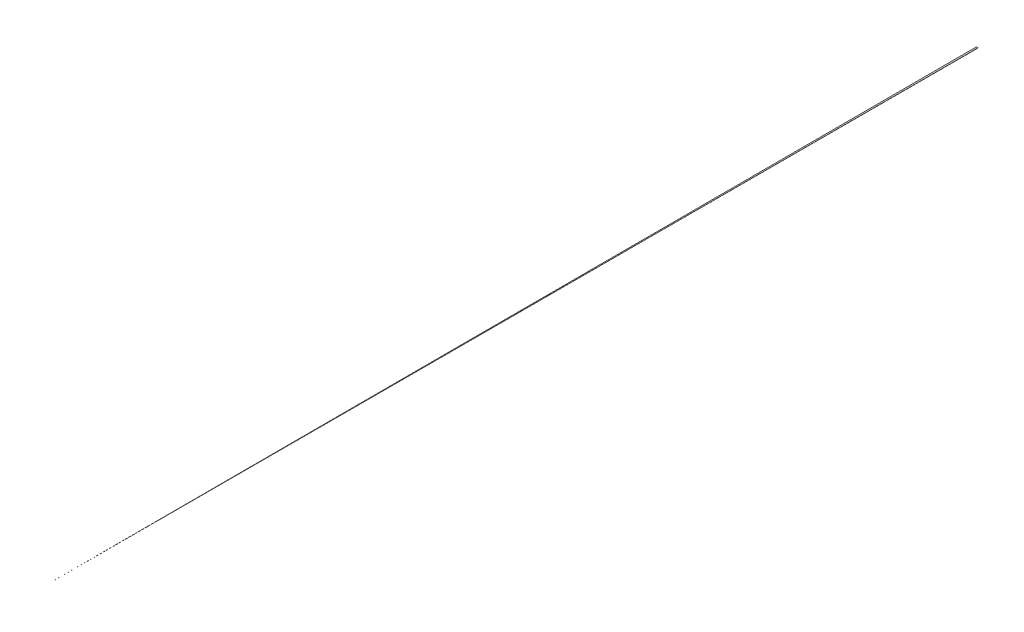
ISO-10303-21;
HEADER;
FILE_DESCRIPTION(('STEP AP214'),'2;1');
FILE_NAME('part.step','',(''),(''),'','','');
FILE_SCHEMA(('AUTOMOTIVE_DESIGN { 1 0 10303 214 1 1 1 1 }'));
ENDSEC;
DATA;
#1=APPLICATION_CONTEXT('core data for automotive mechanical design processes');
#2=APPLICATION_PROTOCOL_DEFINITION('international standard','automotive_design',2000,#1);
#3=PRODUCT_CONTEXT('',#1,'mechanical');
#4=PRODUCT('Part','Part','',(#3));
#5=PRODUCT_RELATED_PRODUCT_CATEGORY('part','',(#4));
#6=PRODUCT_DEFINITION_FORMATION('','',#4);
#7=PRODUCT_DEFINITION_CONTEXT('part definition',#1,'design');
#8=PRODUCT_DEFINITION('design','',#6,#7);
#9=PRODUCT_DEFINITION_SHAPE('','',#8);
#10=(LENGTH_UNIT() NAMED_UNIT(*) SI_UNIT(.MILLI.,.METRE.));
#11=(NAMED_UNIT(*) PLANE_ANGLE_UNIT() SI_UNIT($,.RADIAN.));
#12=(NAMED_UNIT(*) SI_UNIT($,.STERADIAN.) SOLID_ANGLE_UNIT());
#13=UNCERTAINTY_MEASURE_WITH_UNIT(LENGTH_MEASURE(1.E-05),#10,'distance_accuracy_value','');
#14=(GEOMETRIC_REPRESENTATION_CONTEXT(3) GLOBAL_UNCERTAINTY_ASSIGNED_CONTEXT((#13)) GLOBAL_UNIT_ASSIGNED_CONTEXT((#10,
#11,#12)) REPRESENTATION_CONTEXT('',''));
#15=CARTESIAN_POINT('',(0.,0.,0.));
#16=DIRECTION('',(0.,0.,1.));
#17=DIRECTION('',(1.,0.,0.));
#18=AXIS2_PLACEMENT_3D('',#15,#16,#17);
#19=CARTESIAN_POINT('',(0.,0.,31878.1843640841));
#20=DIRECTION('',(0.,0.,-1.));
#21=DIRECTION('',(-1.,0.,0.));
#22=AXIS2_PLACEMENT_3D('',#19,#20,#21);
#23=PLANE('',#22);
#24=DIRECTION('',(0.,1.,0.));
#25=VECTOR('',#24,1.);
#26=CARTESIAN_POINT('',(0.0219870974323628,-20.0500000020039,31878.1843640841));
#27=LINE('',#26,#25);
#28=CARTESIAN_POINT('',(0.0219870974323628,-20.0500000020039,31878.1843640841));
#29=VERTEX_POINT('',#28);
#30=CARTESIAN_POINT('',(0.0219870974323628,-19.9500000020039,31878.1843640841));
#31=VERTEX_POINT('',#30);
#32=EDGE_CURVE('E101',#29,#31,#27,.T.);
#33=ORIENTED_EDGE('',*,*,#32,.T.);
#34=DIRECTION('',(-1.,0.,0.));
#35=VECTOR('',#34,1.);
#36=CARTESIAN_POINT('',(-0.0780129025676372,-19.9500000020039,31878.1843640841));
#37=LINE('',#36,#35);
#38=CARTESIAN_POINT('',(-0.0780129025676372,-19.9500000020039,31878.1843640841));
#39=VERTEX_POINT('',#38);
#40=EDGE_CURVE('E212',#31,#39,#37,.T.);
#41=ORIENTED_EDGE('',*,*,#40,.T.);
#42=DIRECTION('',(0.,-1.,0.));
#43=VECTOR('',#42,1.);
#44=CARTESIAN_POINT('',(-0.0780129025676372,-20.0500000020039,31878.1843640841));
#45=LINE('',#44,#43);
#46=CARTESIAN_POINT('',(-0.0780129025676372,-20.0500000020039,31878.1843640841));
#47=VERTEX_POINT('',#46);
#48=EDGE_CURVE('E61',#39,#47,#45,.T.);
#49=ORIENTED_EDGE('',*,*,#48,.T.);
#50=DIRECTION('',(1.,0.,0.));
#51=VECTOR('',#50,1.);
#52=CARTESIAN_POINT('',(-0.0780129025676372,-20.0500000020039,31878.1843640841));
#53=LINE('',#52,#51);
#54=EDGE_CURVE('E12',#47,#29,#53,.T.);
#55=ORIENTED_EDGE('',*,*,#54,.T.);
#56=EDGE_LOOP('',(#33,#41,#49,#55));
#57=FACE_BOUND('',#56,.T.);
#58=ADVANCED_FACE('F50',(#57),#23,.F.);
#59=CARTESIAN_POINT('',(0.,-23.2499997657,0.00233388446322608));
#60=DIRECTION('',(0.,0.999999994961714,-0.000100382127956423));
#61=DIRECTION('',(0.,0.000100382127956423,0.999999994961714));
#62=AXIS2_PLACEMENT_3D('',#59,#60,#61);
#63=PLANE('',#62);
#64=DIRECTION('',(-0.000899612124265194,0.000100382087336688,0.999999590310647));
#65=VECTOR('',#64,1.);
#66=CARTESIAN_POINT('',(28.7,-23.2499999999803,0.));
#67=LINE('',#66,#65);
#68=CARTESIAN_POINT('',(28.8799224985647,-23.2700764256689,-200.));
#69=VERTEX_POINT('',#68);
#70=EDGE_CURVE('E113',#69,#29,#67,.T.);
#71=ORIENTED_EDGE('',*,*,#70,.T.);
#72=ORIENTED_EDGE('',*,*,#54,.F.);
#73=DIRECTION('',(0.000897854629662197,0.000100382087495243,0.999999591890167));
#74=VECTOR('',#73,1.);
#75=CARTESIAN_POINT('',(-28.7,-23.2499999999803,0.));
#76=LINE('',#75,#74);
#77=CARTESIAN_POINT('',(-28.8795709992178,-23.2700764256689,-200.));
#78=VERTEX_POINT('',#77);
#79=EDGE_CURVE('E76',#78,#47,#76,.T.);
#80=ORIENTED_EDGE('',*,*,#79,.F.);
#81=DIRECTION('',(-1.,0.,0.));
#82=VECTOR('',#81,1.);
#83=CARTESIAN_POINT('',(-28.8795709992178,-23.2700764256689,-200.));
#84=LINE('',#83,#82);
#85=EDGE_CURVE('E122',#69,#78,#84,.T.);
#86=ORIENTED_EDGE('',*,*,#85,.F.);
#87=EDGE_LOOP('',(#71,#72,#80,#86));
#88=FACE_BOUND('',#87,.T.);
#89=ADVANCED_FACE('F142',(#88),#63,.F.);
#90=CARTESIAN_POINT('',(-28.6999768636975,0.,0.0257684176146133));
#91=DIRECTION('',(0.999999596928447,0.,-0.000897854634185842));
#92=DIRECTION('',(-0.000897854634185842,0.,-0.999999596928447));
#93=AXIS2_PLACEMENT_3D('',#90,#91,#92);
#94=PLANE('',#93);
#95=ORIENTED_EDGE('',*,*,#79,.T.);
#96=ORIENTED_EDGE('',*,*,#48,.F.);
#97=DIRECTION('',(0.000897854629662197,-0.000100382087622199,0.999999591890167));
#98=VECTOR('',#97,1.);
#99=CARTESIAN_POINT('',(-28.7,-16.7499999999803,0.));
#100=LINE('',#99,#98);
#101=CARTESIAN_POINT('',(-28.8795709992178,-16.7299235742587,-200.));
#102=VERTEX_POINT('',#101);
#103=EDGE_CURVE('E93',#102,#39,#100,.T.);
#104=ORIENTED_EDGE('',*,*,#103,.F.);
#105=DIRECTION('',(0.,1.,0.));
#106=VECTOR('',#105,1.);
#107=CARTESIAN_POINT('',(-28.8795709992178,-16.7299235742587,-200.));
#108=LINE('',#107,#106);
#109=EDGE_CURVE('E97',#78,#102,#108,.T.);
#110=ORIENTED_EDGE('',*,*,#109,.F.);
#111=EDGE_LOOP('',(#95,#96,#104,#110));
#112=FACE_BOUND('',#111,.T.);
#113=ADVANCED_FACE('F95',(#112),#94,.F.);
#114=CARTESIAN_POINT('',(28.6999767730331,0.,0.0258188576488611));
#115=DIRECTION('',(-0.999999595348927,0.,-0.000899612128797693));
#116=DIRECTION('',(-0.000899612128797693,0.,0.999999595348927));
#117=AXIS2_PLACEMENT_3D('',#114,#115,#116);
#118=PLANE('',#117);
#119=DIRECTION('',(-0.000899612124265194,-0.000100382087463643,0.999999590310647));
#120=VECTOR('',#119,1.);
#121=CARTESIAN_POINT('',(28.7,-16.7499999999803,0.));
#122=LINE('',#121,#120);
#123=CARTESIAN_POINT('',(28.8799224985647,-16.7299235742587,-200.));
#124=VERTEX_POINT('',#123);
#125=EDGE_CURVE('E102',#124,#31,#122,.T.);
#126=ORIENTED_EDGE('',*,*,#125,.T.);
#127=ORIENTED_EDGE('',*,*,#32,.F.);
#128=ORIENTED_EDGE('',*,*,#70,.F.);
#129=DIRECTION('',(0.,-1.,0.));
#130=VECTOR('',#129,1.);
#131=CARTESIAN_POINT('',(28.8799224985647,-16.7299235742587,-200.));
#132=LINE('',#131,#130);
#133=EDGE_CURVE('E114',#124,#69,#132,.T.);
#134=ORIENTED_EDGE('',*,*,#133,.F.);
#135=EDGE_LOOP('',(#126,#127,#128,#134));
#136=FACE_BOUND('',#135,.T.);
#137=ADVANCED_FACE('F189',(#136),#118,.F.);
#138=CARTESIAN_POINT('',(0.,-16.7499998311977,-0.00168140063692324));
#139=DIRECTION('',(0.,-0.999999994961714,-0.000100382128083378));
#140=DIRECTION('',(0.,0.000100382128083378,-0.999999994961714));
#141=AXIS2_PLACEMENT_3D('',#138,#139,#140);
#142=PLANE('',#141);
#143=ORIENTED_EDGE('',*,*,#103,.T.);
#144=ORIENTED_EDGE('',*,*,#40,.F.);
#145=ORIENTED_EDGE('',*,*,#125,.F.);
#146=DIRECTION('',(1.,0.,0.));
#147=VECTOR('',#146,1.);
#148=CARTESIAN_POINT('',(-28.8795709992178,-16.7299235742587,-200.));
#149=LINE('',#148,#147);
#150=EDGE_CURVE('E105',#102,#124,#149,.T.);
#151=ORIENTED_EDGE('',*,*,#150,.F.);
#152=EDGE_LOOP('',(#143,#144,#145,#151));
#153=FACE_BOUND('',#152,.T.);
#154=ADVANCED_FACE('F107',(#153),#142,.F.);
#155=CARTESIAN_POINT('',(0.,0.,-200.));
#156=DIRECTION('',(0.,0.,1.));
#157=DIRECTION('',(1.,0.,0.));
#158=AXIS2_PLACEMENT_3D('',#155,#156,#157);
#159=PLANE('',#158);
#160=ORIENTED_EDGE('',*,*,#109,.T.);
#161=ORIENTED_EDGE('',*,*,#150,.T.);
#162=ORIENTED_EDGE('',*,*,#133,.T.);
#163=ORIENTED_EDGE('',*,*,#85,.T.);
#164=EDGE_LOOP('',(#160,#161,#162,#163));
#165=FACE_BOUND('',#164,.T.);
#166=ADVANCED_FACE('F120',(#165),#159,.F.);
#167=CLOSED_SHELL('',(#58,#89,#113,#137,#154,#166));
#168=MANIFOLD_SOLID_BREP('B2',#167);
#169=ADVANCED_BREP_SHAPE_REPRESENTATION('',(#18,#168),#14);
#170=SHAPE_DEFINITION_REPRESENTATION(#9,#169);
ENDSEC;
END-ISO-10303-21;
